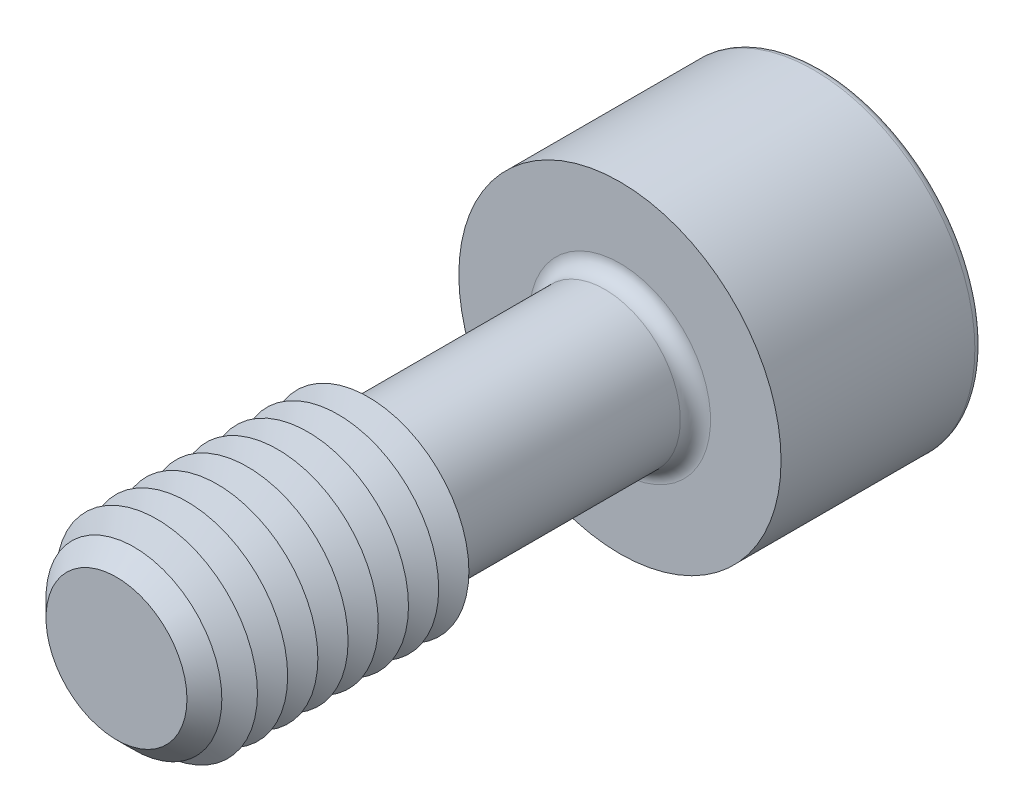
ISO-10303-21;
HEADER;
FILE_DESCRIPTION(('STEP AP214'),'2;1');
FILE_NAME('part.step','',(''),(''),'','','');
FILE_SCHEMA(('AUTOMOTIVE_DESIGN { 1 0 10303 214 1 1 1 1 }'));
ENDSEC;
DATA;
#1=APPLICATION_CONTEXT('core data for automotive mechanical design processes');
#2=APPLICATION_PROTOCOL_DEFINITION('international standard','automotive_design',2000,#1);
#3=PRODUCT_CONTEXT('',#1,'mechanical');
#4=PRODUCT('Part','Part','',(#3));
#5=PRODUCT_RELATED_PRODUCT_CATEGORY('part','',(#4));
#6=PRODUCT_DEFINITION_FORMATION('','',#4);
#7=PRODUCT_DEFINITION_CONTEXT('part definition',#1,'design');
#8=PRODUCT_DEFINITION('design','',#6,#7);
#9=PRODUCT_DEFINITION_SHAPE('','',#8);
#10=(LENGTH_UNIT() NAMED_UNIT(*) SI_UNIT(.MILLI.,.METRE.));
#11=(NAMED_UNIT(*) PLANE_ANGLE_UNIT() SI_UNIT($,.RADIAN.));
#12=(NAMED_UNIT(*) SI_UNIT($,.STERADIAN.) SOLID_ANGLE_UNIT());
#13=UNCERTAINTY_MEASURE_WITH_UNIT(LENGTH_MEASURE(1.E-05),#10,'distance_accuracy_value','');
#14=(GEOMETRIC_REPRESENTATION_CONTEXT(3) GLOBAL_UNCERTAINTY_ASSIGNED_CONTEXT((#13)) GLOBAL_UNIT_ASSIGNED_CONTEXT((#10,
#11,#12)) REPRESENTATION_CONTEXT('',''));
#15=CARTESIAN_POINT('',(0.,0.,0.));
#16=DIRECTION('',(0.,0.,1.));
#17=DIRECTION('',(1.,0.,0.));
#18=AXIS2_PLACEMENT_3D('',#15,#16,#17);
#19=CARTESIAN_POINT('',(-2.3094010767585,-4.,-14.5));
#20=DIRECTION('',(0.,0.,1.));
#21=DIRECTION('',(1.,0.,0.));
#22=AXIS2_PLACEMENT_3D('',#19,#20,#21);
#23=PLANE('',#22);
#24=DIRECTION('',(1.,0.,0.));
#25=VECTOR('',#24,1.);
#26=CARTESIAN_POINT('',(-2.3094010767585,-4.,-14.5));
#27=LINE('',#26,#25);
#28=CARTESIAN_POINT('',(0.,-4.,-14.5));
#29=VERTEX_POINT('',#28);
#30=CARTESIAN_POINT('',(2.3094010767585,-4.,-14.5));
#31=VERTEX_POINT('',#30);
#32=EDGE_CURVE('E761',#29,#31,#27,.T.);
#33=ORIENTED_EDGE('',*,*,#32,.F.);
#34=CARTESIAN_POINT('',(0.,0.,-14.5));
#35=DIRECTION('',(0.,0.,1.));
#36=DIRECTION('',(0.,-1.,0.));
#37=AXIS2_PLACEMENT_3D('',#34,#35,#36);
#38=CIRCLE('',#37,4.);
#39=CARTESIAN_POINT('',(3.46410161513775,-2.,-14.5));
#40=VERTEX_POINT('',#39);
#41=EDGE_CURVE('E53',#29,#40,#38,.T.);
#42=ORIENTED_EDGE('',*,*,#41,.T.);
#43=DIRECTION('',(0.5,0.866025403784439,0.));
#44=VECTOR('',#43,1.);
#45=CARTESIAN_POINT('',(2.3094010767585,-4.,-14.5));
#46=LINE('',#45,#44);
#47=EDGE_CURVE('E747',#31,#40,#46,.T.);
#48=ORIENTED_EDGE('',*,*,#47,.F.);
#49=EDGE_LOOP('',(#33,#42,#48));
#50=FACE_BOUND('',#49,.T.);
#51=ADVANCED_FACE('F41',(#50),#23,.F.);
#52=CARTESIAN_POINT('',(4.618802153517,0.,-14.5));
#53=VERTEX_POINT('',#52);
#54=EDGE_CURVE('E757',#40,#53,#46,.T.);
#55=ORIENTED_EDGE('',*,*,#54,.F.);
#56=CARTESIAN_POINT('',(3.46410161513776,2.,-14.5));
#57=VERTEX_POINT('',#56);
#58=EDGE_CURVE('E11',#40,#57,#38,.T.);
#59=ORIENTED_EDGE('',*,*,#58,.T.);
#60=DIRECTION('',(-0.5,0.866025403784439,0.));
#61=VECTOR('',#60,1.);
#62=CARTESIAN_POINT('',(4.618802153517,0.,-14.5));
#63=LINE('',#62,#61);
#64=EDGE_CURVE('E746',#53,#57,#63,.T.);
#65=ORIENTED_EDGE('',*,*,#64,.F.);
#66=EDGE_LOOP('',(#55,#59,#65));
#67=FACE_BOUND('',#66,.T.);
#68=ADVANCED_FACE('F133',(#67),#23,.F.);
#69=CARTESIAN_POINT('',(2.3094010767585,4.,-14.5));
#70=VERTEX_POINT('',#69);
#71=EDGE_CURVE('E741',#57,#70,#63,.T.);
#72=ORIENTED_EDGE('',*,*,#71,.F.);
#73=CARTESIAN_POINT('',(0.,4.,-14.5));
#74=VERTEX_POINT('',#73);
#75=EDGE_CURVE('E51',#57,#74,#38,.T.);
#76=ORIENTED_EDGE('',*,*,#75,.T.);
#77=DIRECTION('',(-1.,0.,0.));
#78=VECTOR('',#77,1.);
#79=CARTESIAN_POINT('',(2.3094010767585,4.,-14.5));
#80=LINE('',#79,#78);
#81=EDGE_CURVE('E177',#70,#74,#80,.T.);
#82=ORIENTED_EDGE('',*,*,#81,.F.);
#83=EDGE_LOOP('',(#72,#76,#82));
#84=FACE_BOUND('',#83,.T.);
#85=ADVANCED_FACE('F139',(#84),#23,.F.);
#86=CARTESIAN_POINT('',(-2.3094010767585,4.,-14.5));
#87=VERTEX_POINT('',#86);
#88=EDGE_CURVE('E752',#74,#87,#80,.T.);
#89=ORIENTED_EDGE('',*,*,#88,.F.);
#90=CARTESIAN_POINT('',(-3.46410161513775,2.,-14.5));
#91=VERTEX_POINT('',#90);
#92=EDGE_CURVE('E263',#74,#91,#38,.T.);
#93=ORIENTED_EDGE('',*,*,#92,.T.);
#94=DIRECTION('',(-0.500000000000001,-0.866025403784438,0.));
#95=VECTOR('',#94,1.);
#96=CARTESIAN_POINT('',(-2.3094010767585,4.,-14.5));
#97=LINE('',#96,#95);
#98=EDGE_CURVE('E176',#87,#91,#97,.T.);
#99=ORIENTED_EDGE('',*,*,#98,.F.);
#100=EDGE_LOOP('',(#89,#93,#99));
#101=FACE_BOUND('',#100,.T.);
#102=ADVANCED_FACE('F157',(#101),#23,.F.);
#103=CARTESIAN_POINT('',(-4.61880215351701,0.,-14.5));
#104=VERTEX_POINT('',#103);
#105=EDGE_CURVE('E170',#91,#104,#97,.T.);
#106=ORIENTED_EDGE('',*,*,#105,.F.);
#107=CARTESIAN_POINT('',(-3.46410161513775,-2.,-14.5));
#108=VERTEX_POINT('',#107);
#109=EDGE_CURVE('E172',#91,#108,#38,.T.);
#110=ORIENTED_EDGE('',*,*,#109,.T.);
#111=DIRECTION('',(0.5,-0.866025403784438,0.));
#112=VECTOR('',#111,1.);
#113=CARTESIAN_POINT('',(-4.61880215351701,0.,-14.5));
#114=LINE('',#113,#112);
#115=EDGE_CURVE('E174',#104,#108,#114,.T.);
#116=ORIENTED_EDGE('',*,*,#115,.F.);
#117=EDGE_LOOP('',(#106,#110,#116));
#118=FACE_BOUND('',#117,.T.);
#119=ADVANCED_FACE('F146',(#118),#23,.F.);
#120=CARTESIAN_POINT('',(0.,0.,-22.5));
#121=DIRECTION('',(0.,0.,-1.));
#122=DIRECTION('',(-1.,0.,0.));
#123=AXIS2_PLACEMENT_3D('',#120,#121,#122);
#124=PLANE('',#123);
#125=CARTESIAN_POINT('',(0.,0.,-22.5));
#126=DIRECTION('',(0.,0.,-1.));
#127=DIRECTION('',(-1.,0.,0.));
#128=AXIS2_PLACEMENT_3D('',#125,#126,#127);
#129=CIRCLE('',#128,7.625);
#130=CARTESIAN_POINT('',(-7.625,0.,-22.5));
#131=VERTEX_POINT('',#130);
#132=EDGE_CURVE('E250',#131,#131,#129,.T.);
#133=ORIENTED_EDGE('',*,*,#132,.T.);
#134=EDGE_LOOP('',(#133));
#135=FACE_BOUND('',#134,.T.);
#136=DIRECTION('',(-0.500000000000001,-0.866025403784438,0.));
#137=VECTOR('',#136,1.);
#138=CARTESIAN_POINT('',(-2.3094010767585,4.,-22.5));
#139=LINE('',#138,#137);
#140=CARTESIAN_POINT('',(-2.3094010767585,4.,-22.5));
#141=VERTEX_POINT('',#140);
#142=CARTESIAN_POINT('',(-4.61880215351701,0.,-22.5));
#143=VERTEX_POINT('',#142);
#144=EDGE_CURVE('E212',#141,#143,#139,.T.);
#145=ORIENTED_EDGE('',*,*,#144,.T.);
#146=DIRECTION('',(0.5,-0.866025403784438,0.));
#147=VECTOR('',#146,1.);
#148=CARTESIAN_POINT('',(-4.61880215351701,0.,-22.5));
#149=LINE('',#148,#147);
#150=CARTESIAN_POINT('',(-2.3094010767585,-4.,-22.5));
#151=VERTEX_POINT('',#150);
#152=EDGE_CURVE('E67',#143,#151,#149,.T.);
#153=ORIENTED_EDGE('',*,*,#152,.T.);
#154=DIRECTION('',(1.,0.,0.));
#155=VECTOR('',#154,1.);
#156=CARTESIAN_POINT('',(-2.3094010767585,-4.,-22.5));
#157=LINE('',#156,#155);
#158=CARTESIAN_POINT('',(2.3094010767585,-4.,-22.5));
#159=VERTEX_POINT('',#158);
#160=EDGE_CURVE('E196',#151,#159,#157,.T.);
#161=ORIENTED_EDGE('',*,*,#160,.T.);
#162=DIRECTION('',(0.5,0.866025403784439,0.));
#163=VECTOR('',#162,1.);
#164=CARTESIAN_POINT('',(2.3094010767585,-4.,-22.5));
#165=LINE('',#164,#163);
#166=CARTESIAN_POINT('',(4.618802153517,0.,-22.5));
#167=VERTEX_POINT('',#166);
#168=EDGE_CURVE('E200',#159,#167,#165,.T.);
#169=ORIENTED_EDGE('',*,*,#168,.T.);
#170=DIRECTION('',(-0.5,0.866025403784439,0.));
#171=VECTOR('',#170,1.);
#172=CARTESIAN_POINT('',(4.618802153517,0.,-22.5));
#173=LINE('',#172,#171);
#174=CARTESIAN_POINT('',(2.3094010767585,4.,-22.5));
#175=VERTEX_POINT('',#174);
#176=EDGE_CURVE('E204',#167,#175,#173,.T.);
#177=ORIENTED_EDGE('',*,*,#176,.T.);
#178=DIRECTION('',(-1.,0.,0.));
#179=VECTOR('',#178,1.);
#180=CARTESIAN_POINT('',(2.3094010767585,4.,-22.5));
#181=LINE('',#180,#179);
#182=EDGE_CURVE('E208',#175,#141,#181,.T.);
#183=ORIENTED_EDGE('',*,*,#182,.T.);
#184=EDGE_LOOP('',(#145,#153,#161,#169,#177,#183));
#185=FACE_BOUND('',#184,.T.);
#186=ADVANCED_FACE('F156',(#135,#185),#124,.T.);
#187=CARTESIAN_POINT('',(0.,0.,12.5));
#188=DIRECTION('',(0.,0.,-1.));
#189=DIRECTION('',(-1.,0.,0.));
#190=AXIS2_PLACEMENT_3D('',#187,#188,#189);
#191=CYLINDRICAL_SURFACE('',#190,3.75);
#192=CARTESIAN_POINT('',(0.,0.,-11.75));
#193=DIRECTION('',(0.,0.,-1.));
#194=DIRECTION('',(-1.,0.,0.));
#195=AXIS2_PLACEMENT_3D('',#192,#193,#194);
#196=CIRCLE('',#195,3.75);
#197=CARTESIAN_POINT('',(-3.75,0.,-11.75));
#198=VERTEX_POINT('',#197);
#199=EDGE_CURVE('E246',#198,#198,#196,.F.);
#200=ORIENTED_EDGE('',*,*,#199,.T.);
#201=EDGE_LOOP('',(#200));
#202=FACE_BOUND('',#201,.T.);
#203=CARTESIAN_POINT('',(0.,0.,-0.721687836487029));
#204=DIRECTION('',(0.,0.,-1.));
#205=DIRECTION('',(0.,1.,0.));
#206=AXIS2_PLACEMENT_3D('',#203,#204,#205);
#207=CIRCLE('',#206,3.75);
#208=CARTESIAN_POINT('',(0.,3.75,-0.721687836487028));
#209=VERTEX_POINT('',#208);
#210=EDGE_CURVE('E234',#209,#209,#207,.T.);
#211=ORIENTED_EDGE('',*,*,#210,.T.);
#212=EDGE_LOOP('',(#211));
#213=FACE_BOUND('',#212,.T.);
#214=ADVANCED_FACE('F163',(#202,#213),#191,.T.);
#215=CARTESIAN_POINT('',(0.,0.,-0.721687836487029));
#216=DIRECTION('',(0.,0.,1.));
#217=DIRECTION('',(0.,-1.,0.));
#218=AXIS2_PLACEMENT_3D('',#215,#216,#217);
#219=CONICAL_SURFACE('',#218,3.75,1.0471975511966);
#220=CARTESIAN_POINT('',(0.,0.,0.));
#221=DIRECTION('',(0.,0.,-1.));
#222=DIRECTION('',(-1.,0.,0.));
#223=AXIS2_PLACEMENT_3D('',#220,#221,#222);
#224=CIRCLE('',#223,5.);
#225=CARTESIAN_POINT('',(-5.,0.,0.));
#226=VERTEX_POINT('',#225);
#227=EDGE_CURVE('E267',#226,#226,#224,.T.);
#228=ORIENTED_EDGE('',*,*,#227,.T.);
#229=EDGE_LOOP('',(#228));
#230=FACE_BOUND('',#229,.T.);
#231=ORIENTED_EDGE('',*,*,#210,.F.);
#232=EDGE_LOOP('',(#231));
#233=FACE_BOUND('',#232,.T.);
#234=ADVANCED_FACE('F510',(#230,#233),#219,.T.);
#235=CARTESIAN_POINT('',(0.,0.,-12.5));
#236=DIRECTION('',(0.,0.,-1.));
#237=DIRECTION('',(-1.,0.,0.));
#238=AXIS2_PLACEMENT_3D('',#235,#236,#237);
#239=PLANE('',#238);
#240=CARTESIAN_POINT('',(0.,0.,-12.5));
#241=DIRECTION('',(0.,0.,-1.));
#242=DIRECTION('',(-1.,0.,0.));
#243=AXIS2_PLACEMENT_3D('',#240,#241,#242);
#244=CIRCLE('',#243,4.5);
#245=CARTESIAN_POINT('',(-4.5,0.,-12.5));
#246=VERTEX_POINT('',#245);
#247=EDGE_CURVE('E242',#246,#246,#244,.T.);
#248=ORIENTED_EDGE('',*,*,#247,.T.);
#249=EDGE_LOOP('',(#248));
#250=FACE_BOUND('',#249,.T.);
#251=CARTESIAN_POINT('',(0.,0.,-12.5));
#252=DIRECTION('',(0.,0.,-1.));
#253=DIRECTION('',(-1.,0.,0.));
#254=AXIS2_PLACEMENT_3D('',#251,#252,#253);
#255=CIRCLE('',#254,8.);
#256=CARTESIAN_POINT('',(-8.,0.,-12.5));
#257=VERTEX_POINT('',#256);
#258=EDGE_CURVE('E231',#257,#257,#255,.T.);
#259=ORIENTED_EDGE('',*,*,#258,.F.);
#260=EDGE_LOOP('',(#259));
#261=FACE_BOUND('',#260,.T.);
#262=ADVANCED_FACE('F503',(#250,#261),#239,.F.);
#263=CARTESIAN_POINT('',(0.,0.,-22.5));
#264=DIRECTION('',(0.,0.,1.));
#265=DIRECTION('',(1.,0.,0.));
#266=AXIS2_PLACEMENT_3D('',#263,#264,#265);
#267=CYLINDRICAL_SURFACE('',#266,8.);
#268=CARTESIAN_POINT('',(0.,0.,-22.125));
#269=DIRECTION('',(0.,0.,-1.));
#270=DIRECTION('',(-1.,0.,0.));
#271=AXIS2_PLACEMENT_3D('',#268,#269,#270);
#272=CIRCLE('',#271,8.);
#273=CARTESIAN_POINT('',(-8.,0.,-22.125));
#274=VERTEX_POINT('',#273);
#275=EDGE_CURVE('E253',#274,#274,#272,.F.);
#276=ORIENTED_EDGE('',*,*,#275,.T.);
#277=EDGE_LOOP('',(#276));
#278=FACE_BOUND('',#277,.T.);
#279=ORIENTED_EDGE('',*,*,#258,.T.);
#280=EDGE_LOOP('',(#279));
#281=FACE_BOUND('',#280,.T.);
#282=ADVANCED_FACE('F509',(#278,#281),#267,.T.);
#283=CARTESIAN_POINT('',(-4.61880215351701,0.,-14.5));
#284=DIRECTION('',(0.866025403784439,0.5,0.));
#285=DIRECTION('',(-0.5,0.866025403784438,0.));
#286=AXIS2_PLACEMENT_3D('',#283,#284,#285);
#287=PLANE('',#286);
#288=ORIENTED_EDGE('',*,*,#152,.F.);
#289=DIRECTION('',(0.,0.,-1.));
#290=VECTOR('',#289,1.);
#291=CARTESIAN_POINT('',(-4.61880215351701,0.,-14.5));
#292=LINE('',#291,#290);
#293=EDGE_CURVE('E186',#104,#143,#292,.T.);
#294=ORIENTED_EDGE('',*,*,#293,.F.);
#295=ORIENTED_EDGE('',*,*,#115,.T.);
#296=CARTESIAN_POINT('',(-2.3094010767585,-4.,-14.5));
#297=VERTEX_POINT('',#296);
#298=EDGE_CURVE('E215',#108,#297,#114,.T.);
#299=ORIENTED_EDGE('',*,*,#298,.T.);
#300=DIRECTION('',(0.,0.,-1.));
#301=VECTOR('',#300,1.);
#302=CARTESIAN_POINT('',(-2.3094010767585,-4.,-14.5));
#303=LINE('',#302,#301);
#304=EDGE_CURVE('E228',#297,#151,#303,.T.);
#305=ORIENTED_EDGE('',*,*,#304,.T.);
#306=EDGE_LOOP('',(#288,#294,#295,#299,#305));
#307=FACE_BOUND('',#306,.T.);
#308=ADVANCED_FACE('F521',(#307),#287,.T.);
#309=CARTESIAN_POINT('',(-2.3094010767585,-4.,-14.5));
#310=DIRECTION('',(0.,1.,0.));
#311=DIRECTION('',(-1.,0.,0.));
#312=AXIS2_PLACEMENT_3D('',#309,#310,#311);
#313=PLANE('',#312);
#314=ORIENTED_EDGE('',*,*,#160,.F.);
#315=ORIENTED_EDGE('',*,*,#304,.F.);
#316=EDGE_CURVE('E758',#297,#29,#27,.T.);
#317=ORIENTED_EDGE('',*,*,#316,.T.);
#318=ORIENTED_EDGE('',*,*,#32,.T.);
#319=DIRECTION('',(0.,0.,-1.));
#320=VECTOR('',#319,1.);
#321=CARTESIAN_POINT('',(2.3094010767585,-4.,-14.5));
#322=LINE('',#321,#320);
#323=EDGE_CURVE('E225',#31,#159,#322,.T.);
#324=ORIENTED_EDGE('',*,*,#323,.T.);
#325=EDGE_LOOP('',(#314,#315,#317,#318,#324));
#326=FACE_BOUND('',#325,.T.);
#327=ADVANCED_FACE('F537',(#326),#313,.T.);
#328=CARTESIAN_POINT('',(2.3094010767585,-4.,-14.5));
#329=DIRECTION('',(-0.866025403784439,0.5,0.));
#330=DIRECTION('',(-0.5,-0.866025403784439,0.));
#331=AXIS2_PLACEMENT_3D('',#328,#329,#330);
#332=PLANE('',#331);
#333=ORIENTED_EDGE('',*,*,#168,.F.);
#334=ORIENTED_EDGE('',*,*,#323,.F.);
#335=ORIENTED_EDGE('',*,*,#47,.T.);
#336=ORIENTED_EDGE('',*,*,#54,.T.);
#337=DIRECTION('',(0.,0.,-1.));
#338=VECTOR('',#337,1.);
#339=CARTESIAN_POINT('',(4.618802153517,0.,-14.5));
#340=LINE('',#339,#338);
#341=EDGE_CURVE('E222',#53,#167,#340,.T.);
#342=ORIENTED_EDGE('',*,*,#341,.T.);
#343=EDGE_LOOP('',(#333,#334,#335,#336,#342));
#344=FACE_BOUND('',#343,.T.);
#345=ADVANCED_FACE('F547',(#344),#332,.T.);
#346=CARTESIAN_POINT('',(4.618802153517,0.,-14.5));
#347=DIRECTION('',(-0.866025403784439,-0.5,0.));
#348=DIRECTION('',(0.5,-0.866025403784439,0.));
#349=AXIS2_PLACEMENT_3D('',#346,#347,#348);
#350=PLANE('',#349);
#351=ORIENTED_EDGE('',*,*,#176,.F.);
#352=ORIENTED_EDGE('',*,*,#341,.F.);
#353=ORIENTED_EDGE('',*,*,#64,.T.);
#354=ORIENTED_EDGE('',*,*,#71,.T.);
#355=DIRECTION('',(0.,0.,-1.));
#356=VECTOR('',#355,1.);
#357=CARTESIAN_POINT('',(2.3094010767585,4.,-14.5));
#358=LINE('',#357,#356);
#359=EDGE_CURVE('E219',#70,#175,#358,.T.);
#360=ORIENTED_EDGE('',*,*,#359,.T.);
#361=EDGE_LOOP('',(#351,#352,#353,#354,#360));
#362=FACE_BOUND('',#361,.T.);
#363=ADVANCED_FACE('F557',(#362),#350,.T.);
#364=CARTESIAN_POINT('',(2.3094010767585,4.,-14.5));
#365=DIRECTION('',(0.,-1.,0.));
#366=DIRECTION('',(0.,0.,-1.));
#367=AXIS2_PLACEMENT_3D('',#364,#365,#366);
#368=PLANE('',#367);
#369=ORIENTED_EDGE('',*,*,#182,.F.);
#370=ORIENTED_EDGE('',*,*,#359,.F.);
#371=ORIENTED_EDGE('',*,*,#81,.T.);
#372=ORIENTED_EDGE('',*,*,#88,.T.);
#373=DIRECTION('',(0.,0.,-1.));
#374=VECTOR('',#373,1.);
#375=CARTESIAN_POINT('',(-2.3094010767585,4.,-14.5));
#376=LINE('',#375,#374);
#377=EDGE_CURVE('E182',#87,#141,#376,.T.);
#378=ORIENTED_EDGE('',*,*,#377,.T.);
#379=EDGE_LOOP('',(#369,#370,#371,#372,#378));
#380=FACE_BOUND('',#379,.T.);
#381=ADVANCED_FACE('F152',(#380),#368,.T.);
#382=CARTESIAN_POINT('',(-2.3094010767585,4.,-14.5));
#383=DIRECTION('',(0.866025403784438,-0.500000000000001,0.));
#384=DIRECTION('',(0.500000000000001,0.866025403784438,0.));
#385=AXIS2_PLACEMENT_3D('',#382,#383,#384);
#386=PLANE('',#385);
#387=ORIENTED_EDGE('',*,*,#144,.F.);
#388=ORIENTED_EDGE('',*,*,#377,.F.);
#389=ORIENTED_EDGE('',*,*,#98,.T.);
#390=ORIENTED_EDGE('',*,*,#105,.T.);
#391=ORIENTED_EDGE('',*,*,#293,.T.);
#392=EDGE_LOOP('',(#387,#388,#389,#390,#391));
#393=FACE_BOUND('',#392,.T.);
#394=ADVANCED_FACE('F144',(#393),#386,.T.);
#395=ORIENTED_EDGE('',*,*,#298,.F.);
#396=EDGE_CURVE('E256',#108,#29,#38,.T.);
#397=ORIENTED_EDGE('',*,*,#396,.T.);
#398=ORIENTED_EDGE('',*,*,#316,.F.);
#399=EDGE_LOOP('',(#395,#397,#398));
#400=FACE_BOUND('',#399,.T.);
#401=ADVANCED_FACE('F135',(#400),#23,.F.);
#402=CARTESIAN_POINT('',(0.,0.,-11.75));
#403=DIRECTION('',(0.,0.,-1.));
#404=DIRECTION('',(-1.,0.,0.));
#405=AXIS2_PLACEMENT_3D('',#402,#403,#404);
#406=TOROIDAL_SURFACE('',#405,4.5,0.75);
#407=ORIENTED_EDGE('',*,*,#199,.F.);
#408=EDGE_LOOP('',(#407));
#409=FACE_BOUND('',#408,.T.);
#410=ORIENTED_EDGE('',*,*,#247,.F.);
#411=EDGE_LOOP('',(#410));
#412=FACE_BOUND('',#411,.T.);
#413=ADVANCED_FACE('F129',(#409,#412),#406,.F.);
#414=CARTESIAN_POINT('',(0.,0.,-22.125));
#415=DIRECTION('',(0.,0.,-1.));
#416=DIRECTION('',(-1.,0.,0.));
#417=AXIS2_PLACEMENT_3D('',#414,#415,#416);
#418=TOROIDAL_SURFACE('',#417,7.625,0.375);
#419=ORIENTED_EDGE('',*,*,#275,.F.);
#420=EDGE_LOOP('',(#419));
#421=FACE_BOUND('',#420,.T.);
#422=ORIENTED_EDGE('',*,*,#132,.F.);
#423=EDGE_LOOP('',(#422));
#424=FACE_BOUND('',#423,.T.);
#425=ADVANCED_FACE('F43',(#421,#424),#418,.T.);
#426=CARTESIAN_POINT('',(0.,0.,-12.1905989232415));
#427=DIRECTION('',(0.,0.,-1.));
#428=DIRECTION('',(0.,1.,0.));
#429=AXIS2_PLACEMENT_3D('',#426,#427,#428);
#430=CONICAL_SURFACE('',#429,0.,1.0471975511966);
#431=ORIENTED_EDGE('',*,*,#41,.F.);
#432=ORIENTED_EDGE('',*,*,#396,.F.);
#433=ORIENTED_EDGE('',*,*,#109,.F.);
#434=ORIENTED_EDGE('',*,*,#92,.F.);
#435=ORIENTED_EDGE('',*,*,#75,.F.);
#436=ORIENTED_EDGE('',*,*,#58,.F.);
#437=EDGE_LOOP('',(#431,#432,#433,#434,#435,#436));
#438=FACE_BOUND('',#437,.T.);
#439=CARTESIAN_POINT('',(0.,0.,-12.1905989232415));
#440=VERTEX_POINT('',#439);
#441=VERTEX_LOOP('',#440);
#442=FACE_BOUND('',#441,.T.);
#443=ADVANCED_FACE('F118',(#438,#442),#430,.F.);
#444=CARTESIAN_POINT('',(0.,0.,0.750000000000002));
#445=DIRECTION('',(0.,0.,-1.));
#446=DIRECTION('',(-1.,0.,0.));
#447=AXIS2_PLACEMENT_3D('',#444,#445,#446);
#448=CONICAL_SURFACE('',#447,3.70096189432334,1.0471975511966);
#449=ORIENTED_EDGE('',*,*,#227,.F.);
#450=EDGE_LOOP('',(#449));
#451=FACE_BOUND('',#450,.T.);
#452=CARTESIAN_POINT('',(0.,0.,0.750000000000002));
#453=DIRECTION('',(0.,0.,-1.));
#454=DIRECTION('',(-1.,0.,0.));
#455=AXIS2_PLACEMENT_3D('',#452,#453,#454);
#456=CIRCLE('',#455,3.70096189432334);
#457=CARTESIAN_POINT('',(-3.70096189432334,0.,0.750000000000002));
#458=VERTEX_POINT('',#457);
#459=EDGE_CURVE('E273',#458,#458,#456,.T.);
#460=ORIENTED_EDGE('',*,*,#459,.T.);
#461=EDGE_LOOP('',(#460));
#462=FACE_BOUND('',#461,.T.);
#463=ADVANCED_FACE('F120',(#451,#462),#448,.T.);
#464=CARTESIAN_POINT('',(0.,0.,1.5));
#465=DIRECTION('',(0.,0.,1.));
#466=DIRECTION('',(1.,0.,0.));
#467=AXIS2_PLACEMENT_3D('',#464,#465,#466);
#468=CONICAL_SURFACE('',#467,5.,1.0471975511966);
#469=ORIENTED_EDGE('',*,*,#459,.F.);
#470=EDGE_LOOP('',(#469));
#471=FACE_BOUND('',#470,.T.);
#472=CARTESIAN_POINT('',(0.,0.,1.5));
#473=DIRECTION('',(0.,0.,-1.));
#474=DIRECTION('',(-1.,0.,0.));
#475=AXIS2_PLACEMENT_3D('',#472,#473,#474);
#476=CIRCLE('',#475,5.);
#477=CARTESIAN_POINT('',(-5.,0.,1.5));
#478=VERTEX_POINT('',#477);
#479=EDGE_CURVE('E278',#478,#478,#476,.T.);
#480=ORIENTED_EDGE('',*,*,#479,.T.);
#481=EDGE_LOOP('',(#480));
#482=FACE_BOUND('',#481,.T.);
#483=ADVANCED_FACE('F126',(#471,#482),#468,.T.);
#484=CARTESIAN_POINT('',(0.,0.,2.25));
#485=DIRECTION('',(0.,0.,-1.));
#486=DIRECTION('',(-1.,0.,0.));
#487=AXIS2_PLACEMENT_3D('',#484,#485,#486);
#488=CONICAL_SURFACE('',#487,3.70096189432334,1.0471975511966);
#489=ORIENTED_EDGE('',*,*,#479,.F.);
#490=EDGE_LOOP('',(#489));
#491=FACE_BOUND('',#490,.T.);
#492=CARTESIAN_POINT('',(0.,0.,2.25));
#493=DIRECTION('',(0.,0.,-1.));
#494=DIRECTION('',(-1.,0.,0.));
#495=AXIS2_PLACEMENT_3D('',#492,#493,#494);
#496=CIRCLE('',#495,3.70096189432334);
#497=CARTESIAN_POINT('',(-3.70096189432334,0.,2.25));
#498=VERTEX_POINT('',#497);
#499=EDGE_CURVE('E284',#498,#498,#496,.T.);
#500=ORIENTED_EDGE('',*,*,#499,.T.);
#501=EDGE_LOOP('',(#500));
#502=FACE_BOUND('',#501,.T.);
#503=ADVANCED_FACE('F397',(#491,#502),#488,.T.);
#504=CARTESIAN_POINT('',(0.,0.,3.));
#505=DIRECTION('',(0.,0.,1.));
#506=DIRECTION('',(1.,0.,0.));
#507=AXIS2_PLACEMENT_3D('',#504,#505,#506);
#508=CONICAL_SURFACE('',#507,5.,1.0471975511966);
#509=ORIENTED_EDGE('',*,*,#499,.F.);
#510=EDGE_LOOP('',(#509));
#511=FACE_BOUND('',#510,.T.);
#512=CARTESIAN_POINT('',(0.,0.,3.));
#513=DIRECTION('',(0.,0.,-1.));
#514=DIRECTION('',(-1.,0.,0.));
#515=AXIS2_PLACEMENT_3D('',#512,#513,#514);
#516=CIRCLE('',#515,5.);
#517=CARTESIAN_POINT('',(-5.,0.,3.));
#518=VERTEX_POINT('',#517);
#519=EDGE_CURVE('E288',#518,#518,#516,.T.);
#520=ORIENTED_EDGE('',*,*,#519,.T.);
#521=EDGE_LOOP('',(#520));
#522=FACE_BOUND('',#521,.T.);
#523=ADVANCED_FACE('F393',(#511,#522),#508,.T.);
#524=CARTESIAN_POINT('',(0.,0.,3.75));
#525=DIRECTION('',(0.,0.,-1.));
#526=DIRECTION('',(-1.,0.,0.));
#527=AXIS2_PLACEMENT_3D('',#524,#525,#526);
#528=CONICAL_SURFACE('',#527,3.70096189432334,1.0471975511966);
#529=ORIENTED_EDGE('',*,*,#519,.F.);
#530=EDGE_LOOP('',(#529));
#531=FACE_BOUND('',#530,.T.);
#532=CARTESIAN_POINT('',(0.,0.,3.75));
#533=DIRECTION('',(0.,0.,-1.));
#534=DIRECTION('',(-1.,0.,0.));
#535=AXIS2_PLACEMENT_3D('',#532,#533,#534);
#536=CIRCLE('',#535,3.70096189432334);
#537=CARTESIAN_POINT('',(-3.70096189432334,0.,3.75));
#538=VERTEX_POINT('',#537);
#539=EDGE_CURVE('E292',#538,#538,#536,.T.);
#540=ORIENTED_EDGE('',*,*,#539,.T.);
#541=EDGE_LOOP('',(#540));
#542=FACE_BOUND('',#541,.T.);
#543=ADVANCED_FACE('F389',(#531,#542),#528,.T.);
#544=CARTESIAN_POINT('',(0.,0.,4.5));
#545=DIRECTION('',(0.,0.,1.));
#546=DIRECTION('',(1.,0.,0.));
#547=AXIS2_PLACEMENT_3D('',#544,#545,#546);
#548=CONICAL_SURFACE('',#547,5.,1.0471975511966);
#549=ORIENTED_EDGE('',*,*,#539,.F.);
#550=EDGE_LOOP('',(#549));
#551=FACE_BOUND('',#550,.T.);
#552=CARTESIAN_POINT('',(0.,0.,4.5));
#553=DIRECTION('',(0.,0.,-1.));
#554=DIRECTION('',(-1.,0.,0.));
#555=AXIS2_PLACEMENT_3D('',#552,#553,#554);
#556=CIRCLE('',#555,5.);
#557=CARTESIAN_POINT('',(-5.,0.,4.5));
#558=VERTEX_POINT('',#557);
#559=EDGE_CURVE('E296',#558,#558,#556,.T.);
#560=ORIENTED_EDGE('',*,*,#559,.T.);
#561=EDGE_LOOP('',(#560));
#562=FACE_BOUND('',#561,.T.);
#563=ADVANCED_FACE('F385',(#551,#562),#548,.T.);
#564=CARTESIAN_POINT('',(0.,0.,5.25));
#565=DIRECTION('',(0.,0.,-1.));
#566=DIRECTION('',(-1.,0.,0.));
#567=AXIS2_PLACEMENT_3D('',#564,#565,#566);
#568=CONICAL_SURFACE('',#567,3.70096189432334,1.0471975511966);
#569=ORIENTED_EDGE('',*,*,#559,.F.);
#570=EDGE_LOOP('',(#569));
#571=FACE_BOUND('',#570,.T.);
#572=CARTESIAN_POINT('',(0.,0.,5.25));
#573=DIRECTION('',(0.,0.,-1.));
#574=DIRECTION('',(-1.,0.,0.));
#575=AXIS2_PLACEMENT_3D('',#572,#573,#574);
#576=CIRCLE('',#575,3.70096189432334);
#577=CARTESIAN_POINT('',(-3.70096189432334,0.,5.25));
#578=VERTEX_POINT('',#577);
#579=EDGE_CURVE('E300',#578,#578,#576,.T.);
#580=ORIENTED_EDGE('',*,*,#579,.T.);
#581=EDGE_LOOP('',(#580));
#582=FACE_BOUND('',#581,.T.);
#583=ADVANCED_FACE('F381',(#571,#582),#568,.T.);
#584=CARTESIAN_POINT('',(0.,0.,6.));
#585=DIRECTION('',(0.,0.,1.));
#586=DIRECTION('',(1.,0.,0.));
#587=AXIS2_PLACEMENT_3D('',#584,#585,#586);
#588=CONICAL_SURFACE('',#587,5.,1.0471975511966);
#589=ORIENTED_EDGE('',*,*,#579,.F.);
#590=EDGE_LOOP('',(#589));
#591=FACE_BOUND('',#590,.T.);
#592=CARTESIAN_POINT('',(0.,0.,6.));
#593=DIRECTION('',(0.,0.,-1.));
#594=DIRECTION('',(-1.,0.,0.));
#595=AXIS2_PLACEMENT_3D('',#592,#593,#594);
#596=CIRCLE('',#595,5.);
#597=CARTESIAN_POINT('',(-5.,0.,6.));
#598=VERTEX_POINT('',#597);
#599=EDGE_CURVE('E304',#598,#598,#596,.T.);
#600=ORIENTED_EDGE('',*,*,#599,.T.);
#601=EDGE_LOOP('',(#600));
#602=FACE_BOUND('',#601,.T.);
#603=ADVANCED_FACE('F377',(#591,#602),#588,.T.);
#604=CARTESIAN_POINT('',(0.,0.,6.75));
#605=DIRECTION('',(0.,0.,-1.));
#606=DIRECTION('',(-1.,0.,0.));
#607=AXIS2_PLACEMENT_3D('',#604,#605,#606);
#608=CONICAL_SURFACE('',#607,3.70096189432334,1.0471975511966);
#609=ORIENTED_EDGE('',*,*,#599,.F.);
#610=EDGE_LOOP('',(#609));
#611=FACE_BOUND('',#610,.T.);
#612=CARTESIAN_POINT('',(0.,0.,6.75));
#613=DIRECTION('',(0.,0.,-1.));
#614=DIRECTION('',(-1.,0.,0.));
#615=AXIS2_PLACEMENT_3D('',#612,#613,#614);
#616=CIRCLE('',#615,3.70096189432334);
#617=CARTESIAN_POINT('',(-3.70096189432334,0.,6.75));
#618=VERTEX_POINT('',#617);
#619=EDGE_CURVE('E308',#618,#618,#616,.T.);
#620=ORIENTED_EDGE('',*,*,#619,.T.);
#621=EDGE_LOOP('',(#620));
#622=FACE_BOUND('',#621,.T.);
#623=ADVANCED_FACE('F373',(#611,#622),#608,.T.);
#624=CARTESIAN_POINT('',(0.,0.,7.5));
#625=DIRECTION('',(0.,0.,1.));
#626=DIRECTION('',(1.,0.,0.));
#627=AXIS2_PLACEMENT_3D('',#624,#625,#626);
#628=CONICAL_SURFACE('',#627,5.,1.0471975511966);
#629=ORIENTED_EDGE('',*,*,#619,.F.);
#630=EDGE_LOOP('',(#629));
#631=FACE_BOUND('',#630,.T.);
#632=CARTESIAN_POINT('',(0.,0.,7.5));
#633=DIRECTION('',(0.,0.,-1.));
#634=DIRECTION('',(-1.,0.,0.));
#635=AXIS2_PLACEMENT_3D('',#632,#633,#634);
#636=CIRCLE('',#635,5.);
#637=CARTESIAN_POINT('',(-5.,0.,7.5));
#638=VERTEX_POINT('',#637);
#639=EDGE_CURVE('E312',#638,#638,#636,.T.);
#640=ORIENTED_EDGE('',*,*,#639,.T.);
#641=EDGE_LOOP('',(#640));
#642=FACE_BOUND('',#641,.T.);
#643=ADVANCED_FACE('F369',(#631,#642),#628,.T.);
#644=CARTESIAN_POINT('',(0.,0.,8.25));
#645=DIRECTION('',(0.,0.,-1.));
#646=DIRECTION('',(-1.,0.,0.));
#647=AXIS2_PLACEMENT_3D('',#644,#645,#646);
#648=CONICAL_SURFACE('',#647,3.70096189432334,1.0471975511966);
#649=ORIENTED_EDGE('',*,*,#639,.F.);
#650=EDGE_LOOP('',(#649));
#651=FACE_BOUND('',#650,.T.);
#652=CARTESIAN_POINT('',(0.,0.,8.25));
#653=DIRECTION('',(0.,0.,-1.));
#654=DIRECTION('',(-1.,0.,0.));
#655=AXIS2_PLACEMENT_3D('',#652,#653,#654);
#656=CIRCLE('',#655,3.70096189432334);
#657=CARTESIAN_POINT('',(-3.70096189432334,0.,8.25));
#658=VERTEX_POINT('',#657);
#659=EDGE_CURVE('E316',#658,#658,#656,.T.);
#660=ORIENTED_EDGE('',*,*,#659,.T.);
#661=EDGE_LOOP('',(#660));
#662=FACE_BOUND('',#661,.T.);
#663=ADVANCED_FACE('F365',(#651,#662),#648,.T.);
#664=CARTESIAN_POINT('',(0.,0.,9.));
#665=DIRECTION('',(0.,0.,1.));
#666=DIRECTION('',(1.,0.,0.));
#667=AXIS2_PLACEMENT_3D('',#664,#665,#666);
#668=CONICAL_SURFACE('',#667,5.,1.0471975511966);
#669=ORIENTED_EDGE('',*,*,#659,.F.);
#670=EDGE_LOOP('',(#669));
#671=FACE_BOUND('',#670,.T.);
#672=CARTESIAN_POINT('',(0.,0.,9.));
#673=DIRECTION('',(0.,0.,-1.));
#674=DIRECTION('',(-1.,0.,0.));
#675=AXIS2_PLACEMENT_3D('',#672,#673,#674);
#676=CIRCLE('',#675,5.);
#677=CARTESIAN_POINT('',(-5.,0.,9.));
#678=VERTEX_POINT('',#677);
#679=EDGE_CURVE('E320',#678,#678,#676,.T.);
#680=ORIENTED_EDGE('',*,*,#679,.T.);
#681=EDGE_LOOP('',(#680));
#682=FACE_BOUND('',#681,.T.);
#683=ADVANCED_FACE('F361',(#671,#682),#668,.T.);
#684=CARTESIAN_POINT('',(0.,0.,9.75));
#685=DIRECTION('',(0.,0.,-1.));
#686=DIRECTION('',(-1.,0.,0.));
#687=AXIS2_PLACEMENT_3D('',#684,#685,#686);
#688=CONICAL_SURFACE('',#687,3.70096189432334,1.0471975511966);
#689=ORIENTED_EDGE('',*,*,#679,.F.);
#690=EDGE_LOOP('',(#689));
#691=FACE_BOUND('',#690,.T.);
#692=CARTESIAN_POINT('',(0.,0.,9.75));
#693=DIRECTION('',(0.,0.,-1.));
#694=DIRECTION('',(-1.,0.,0.));
#695=AXIS2_PLACEMENT_3D('',#692,#693,#694);
#696=CIRCLE('',#695,3.70096189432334);
#697=CARTESIAN_POINT('',(-3.70096189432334,0.,9.75));
#698=VERTEX_POINT('',#697);
#699=EDGE_CURVE('E324',#698,#698,#696,.T.);
#700=ORIENTED_EDGE('',*,*,#699,.T.);
#701=EDGE_LOOP('',(#700));
#702=FACE_BOUND('',#701,.T.);
#703=ADVANCED_FACE('F357',(#691,#702),#688,.T.);
#704=CARTESIAN_POINT('',(0.,0.,10.5));
#705=DIRECTION('',(0.,0.,1.));
#706=DIRECTION('',(1.,0.,0.));
#707=AXIS2_PLACEMENT_3D('',#704,#705,#706);
#708=CONICAL_SURFACE('',#707,5.,1.0471975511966);
#709=ORIENTED_EDGE('',*,*,#699,.F.);
#710=EDGE_LOOP('',(#709));
#711=FACE_BOUND('',#710,.T.);
#712=CARTESIAN_POINT('',(0.,0.,10.5));
#713=DIRECTION('',(0.,0.,-1.));
#714=DIRECTION('',(-1.,0.,0.));
#715=AXIS2_PLACEMENT_3D('',#712,#713,#714);
#716=CIRCLE('',#715,5.);
#717=CARTESIAN_POINT('',(-5.,0.,10.5));
#718=VERTEX_POINT('',#717);
#719=EDGE_CURVE('E327',#718,#718,#716,.T.);
#720=ORIENTED_EDGE('',*,*,#719,.T.);
#721=EDGE_LOOP('',(#720));
#722=FACE_BOUND('',#721,.T.);
#723=ADVANCED_FACE('F350',(#711,#722),#708,.T.);
#724=CARTESIAN_POINT('',(0.,0.,11.25));
#725=DIRECTION('',(0.,0.,-1.));
#726=DIRECTION('',(-1.,0.,0.));
#727=AXIS2_PLACEMENT_3D('',#724,#725,#726);
#728=CONICAL_SURFACE('',#727,3.70096189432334,1.0471975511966);
#729=ORIENTED_EDGE('',*,*,#719,.F.);
#730=EDGE_LOOP('',(#729));
#731=FACE_BOUND('',#730,.T.);
#732=CARTESIAN_POINT('',(0.,0.,11.25));
#733=DIRECTION('',(0.,0.,-1.));
#734=DIRECTION('',(-1.,0.,0.));
#735=AXIS2_PLACEMENT_3D('',#732,#733,#734);
#736=CIRCLE('',#735,3.70096189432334);
#737=CARTESIAN_POINT('',(-3.70096189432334,0.,11.25));
#738=VERTEX_POINT('',#737);
#739=EDGE_CURVE('E331',#738,#738,#736,.T.);
#740=ORIENTED_EDGE('',*,*,#739,.T.);
#741=EDGE_LOOP('',(#740));
#742=FACE_BOUND('',#741,.T.);
#743=ADVANCED_FACE('F336',(#731,#742),#728,.T.);
#744=CARTESIAN_POINT('',(0.,0.,12.));
#745=DIRECTION('',(0.,0.,1.));
#746=DIRECTION('',(1.,0.,0.));
#747=AXIS2_PLACEMENT_3D('',#744,#745,#746);
#748=CONICAL_SURFACE('',#747,5.,1.0471975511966);
#749=CARTESIAN_POINT('',(0.,0.,11.6339745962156));
#750=DIRECTION('',(0.,0.,1.));
#751=DIRECTION('',(1.,0.,0.));
#752=AXIS2_PLACEMENT_3D('',#749,#750,#751);
#753=CIRCLE('',#752,4.36602540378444);
#754=CARTESIAN_POINT('',(4.36602540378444,0.,11.6339745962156));
#755=VERTEX_POINT('',#754);
#756=EDGE_CURVE('E45',#755,#755,#753,.F.);
#757=ORIENTED_EDGE('',*,*,#756,.T.);
#758=EDGE_LOOP('',(#757));
#759=FACE_BOUND('',#758,.T.);
#760=ORIENTED_EDGE('',*,*,#739,.F.);
#761=EDGE_LOOP('',(#760));
#762=FACE_BOUND('',#761,.T.);
#763=ADVANCED_FACE('F338',(#759,#762),#748,.T.);
#764=CARTESIAN_POINT('',(0.,0.,12.5));
#765=DIRECTION('',(0.,0.,1.));
#766=DIRECTION('',(1.,0.,0.));
#767=AXIS2_PLACEMENT_3D('',#764,#765,#766);
#768=PLANE('',#767);
#769=CARTESIAN_POINT('',(0.,0.,12.5));
#770=DIRECTION('',(0.,0.,1.));
#771=DIRECTION('',(1.,0.,0.));
#772=AXIS2_PLACEMENT_3D('',#769,#770,#771);
#773=CIRCLE('',#772,3.5);
#774=CARTESIAN_POINT('',(3.5,0.,12.5));
#775=VERTEX_POINT('',#774);
#776=EDGE_CURVE('E238',#775,#775,#773,.T.);
#777=ORIENTED_EDGE('',*,*,#776,.T.);
#778=EDGE_LOOP('',(#777));
#779=FACE_BOUND('',#778,.T.);
#780=ADVANCED_FACE('F340',(#779),#768,.T.);
#781=CARTESIAN_POINT('',(0.,0.,11.));
#782=DIRECTION('',(0.,0.,-1.));
#783=DIRECTION('',(0.,1.,0.));
#784=AXIS2_PLACEMENT_3D('',#781,#782,#783);
#785=CONICAL_SURFACE('',#784,5.,0.785398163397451);
#786=ORIENTED_EDGE('',*,*,#756,.F.);
#787=EDGE_LOOP('',(#786));
#788=FACE_BOUND('',#787,.T.);
#789=ORIENTED_EDGE('',*,*,#776,.F.);
#790=EDGE_LOOP('',(#789));
#791=FACE_BOUND('',#790,.T.);
#792=ADVANCED_FACE('F347',(#788,#791),#785,.T.);
#793=CLOSED_SHELL('',(#51,#68,#85,#102,#119,#186,#214,#234,#262,#282,#308,#327,#345,#363,#381,
#394,#401,#413,#425,#443,#463,#483,#503,#523,#543,#563,#583,#603,#623,#643,#663,#683,#703,#723,
#743,#763,#780,#792));
#794=MANIFOLD_SOLID_BREP('B2',#793);
#795=ADVANCED_BREP_SHAPE_REPRESENTATION('',(#18,#794),#14);
#796=SHAPE_DEFINITION_REPRESENTATION(#9,#795);
ENDSEC;
END-ISO-10303-21;
